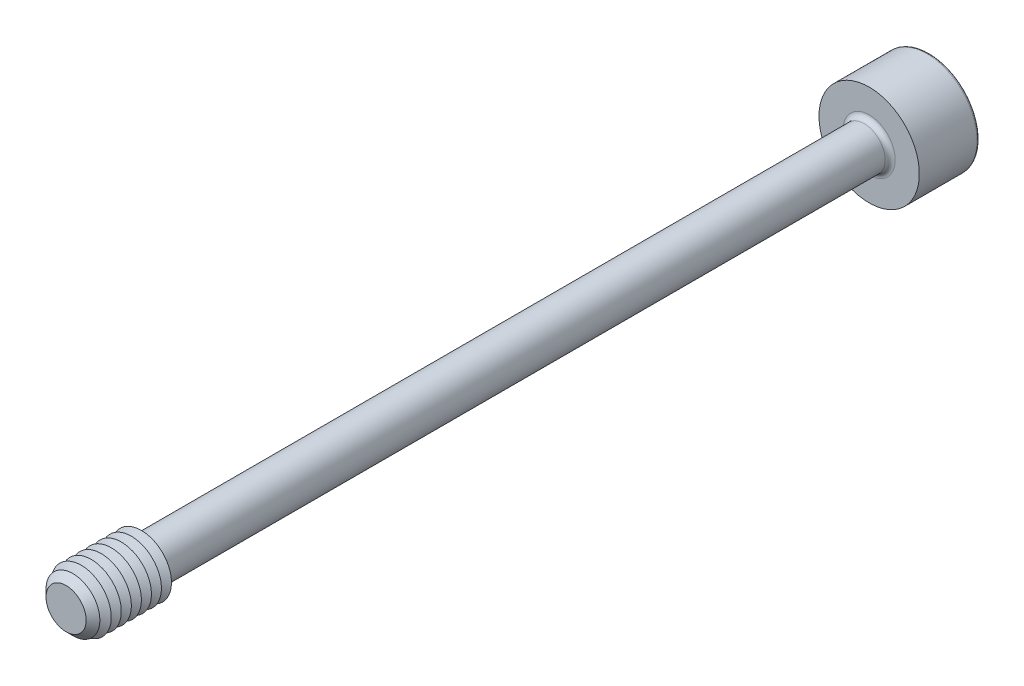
ISO-10303-21;
HEADER;
FILE_DESCRIPTION(('STEP AP214'),'2;1');
FILE_NAME('part.step','',(''),(''),'','','');
FILE_SCHEMA(('AUTOMOTIVE_DESIGN { 1 0 10303 214 1 1 1 1 }'));
ENDSEC;
DATA;
#1=APPLICATION_CONTEXT('core data for automotive mechanical design processes');
#2=APPLICATION_PROTOCOL_DEFINITION('international standard','automotive_design',2000,#1);
#3=PRODUCT_CONTEXT('',#1,'mechanical');
#4=PRODUCT('Part','Part','',(#3));
#5=PRODUCT_RELATED_PRODUCT_CATEGORY('part','',(#4));
#6=PRODUCT_DEFINITION_FORMATION('','',#4);
#7=PRODUCT_DEFINITION_CONTEXT('part definition',#1,'design');
#8=PRODUCT_DEFINITION('design','',#6,#7);
#9=PRODUCT_DEFINITION_SHAPE('','',#8);
#10=(LENGTH_UNIT() NAMED_UNIT(*) SI_UNIT(.MILLI.,.METRE.));
#11=(NAMED_UNIT(*) PLANE_ANGLE_UNIT() SI_UNIT($,.RADIAN.));
#12=(NAMED_UNIT(*) SI_UNIT($,.STERADIAN.) SOLID_ANGLE_UNIT());
#13=UNCERTAINTY_MEASURE_WITH_UNIT(LENGTH_MEASURE(1.E-05),#10,'distance_accuracy_value','');
#14=(GEOMETRIC_REPRESENTATION_CONTEXT(3) GLOBAL_UNCERTAINTY_ASSIGNED_CONTEXT((#13)) GLOBAL_UNIT_ASSIGNED_CONTEXT((#10,
#11,#12)) REPRESENTATION_CONTEXT('',''));
#15=CARTESIAN_POINT('',(0.,0.,0.));
#16=DIRECTION('',(0.,0.,1.));
#17=DIRECTION('',(1.,0.,0.));
#18=AXIS2_PLACEMENT_3D('',#15,#16,#17);
#19=CARTESIAN_POINT('',(-1.44337567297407,-2.5,-41.));
#20=DIRECTION('',(0.,0.,1.));
#21=DIRECTION('',(1.,0.,0.));
#22=AXIS2_PLACEMENT_3D('',#19,#20,#21);
#23=PLANE('',#22);
#24=DIRECTION('',(1.,0.,0.));
#25=VECTOR('',#24,1.);
#26=CARTESIAN_POINT('',(-1.44337567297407,-2.5,-41.));
#27=LINE('',#26,#25);
#28=CARTESIAN_POINT('',(0.,-2.5,-41.));
#29=VERTEX_POINT('',#28);
#30=CARTESIAN_POINT('',(1.44337567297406,-2.5,-41.));
#31=VERTEX_POINT('',#30);
#32=EDGE_CURVE('E726',#29,#31,#27,.T.);
#33=ORIENTED_EDGE('',*,*,#32,.F.);
#34=CARTESIAN_POINT('',(0.,0.,-41.));
#35=DIRECTION('',(0.,0.,1.));
#36=DIRECTION('',(0.,-1.,0.));
#37=AXIS2_PLACEMENT_3D('',#34,#35,#36);
#38=CIRCLE('',#37,2.5);
#39=CARTESIAN_POINT('',(2.1650635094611,-1.25,-41.));
#40=VERTEX_POINT('',#39);
#41=EDGE_CURVE('E53',#29,#40,#38,.T.);
#42=ORIENTED_EDGE('',*,*,#41,.T.);
#43=DIRECTION('',(0.5,0.866025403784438,0.));
#44=VECTOR('',#43,1.);
#45=CARTESIAN_POINT('',(1.44337567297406,-2.5,-41.));
#46=LINE('',#45,#44);
#47=EDGE_CURVE('E713',#31,#40,#46,.T.);
#48=ORIENTED_EDGE('',*,*,#47,.F.);
#49=EDGE_LOOP('',(#33,#42,#48));
#50=FACE_BOUND('',#49,.T.);
#51=ADVANCED_FACE('F41',(#50),#23,.F.);
#52=CARTESIAN_POINT('',(2.88675134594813,0.,-41.));
#53=VERTEX_POINT('',#52);
#54=EDGE_CURVE('E723',#40,#53,#46,.T.);
#55=ORIENTED_EDGE('',*,*,#54,.F.);
#56=CARTESIAN_POINT('',(2.1650635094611,1.25,-41.));
#57=VERTEX_POINT('',#56);
#58=EDGE_CURVE('E11',#40,#57,#38,.T.);
#59=ORIENTED_EDGE('',*,*,#58,.T.);
#60=DIRECTION('',(-0.5,0.866025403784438,0.));
#61=VECTOR('',#60,1.);
#62=CARTESIAN_POINT('',(2.88675134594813,0.,-41.));
#63=LINE('',#62,#61);
#64=EDGE_CURVE('E712',#53,#57,#63,.T.);
#65=ORIENTED_EDGE('',*,*,#64,.F.);
#66=EDGE_LOOP('',(#55,#59,#65));
#67=FACE_BOUND('',#66,.T.);
#68=ADVANCED_FACE('F133',(#67),#23,.F.);
#69=CARTESIAN_POINT('',(1.44337567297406,2.5,-41.));
#70=VERTEX_POINT('',#69);
#71=EDGE_CURVE('E707',#57,#70,#63,.T.);
#72=ORIENTED_EDGE('',*,*,#71,.F.);
#73=CARTESIAN_POINT('',(0.,2.5,-41.));
#74=VERTEX_POINT('',#73);
#75=EDGE_CURVE('E51',#57,#74,#38,.T.);
#76=ORIENTED_EDGE('',*,*,#75,.T.);
#77=DIRECTION('',(-1.,0.,0.));
#78=VECTOR('',#77,1.);
#79=CARTESIAN_POINT('',(1.44337567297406,2.5,-41.));
#80=LINE('',#79,#78);
#81=EDGE_CURVE('E177',#70,#74,#80,.T.);
#82=ORIENTED_EDGE('',*,*,#81,.F.);
#83=EDGE_LOOP('',(#72,#76,#82));
#84=FACE_BOUND('',#83,.T.);
#85=ADVANCED_FACE('F139',(#84),#23,.F.);
#86=CARTESIAN_POINT('',(-1.44337567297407,2.5,-41.));
#87=VERTEX_POINT('',#86);
#88=EDGE_CURVE('E717',#74,#87,#80,.T.);
#89=ORIENTED_EDGE('',*,*,#88,.F.);
#90=CARTESIAN_POINT('',(-2.1650635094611,1.25,-41.));
#91=VERTEX_POINT('',#90);
#92=EDGE_CURVE('E265',#74,#91,#38,.T.);
#93=ORIENTED_EDGE('',*,*,#92,.T.);
#94=DIRECTION('',(-0.5,-0.866025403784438,0.));
#95=VECTOR('',#94,1.);
#96=CARTESIAN_POINT('',(-1.44337567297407,2.5,-41.));
#97=LINE('',#96,#95);
#98=EDGE_CURVE('E176',#87,#91,#97,.T.);
#99=ORIENTED_EDGE('',*,*,#98,.F.);
#100=EDGE_LOOP('',(#89,#93,#99));
#101=FACE_BOUND('',#100,.T.);
#102=ADVANCED_FACE('F157',(#101),#23,.F.);
#103=CARTESIAN_POINT('',(-2.88675134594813,0.,-41.));
#104=VERTEX_POINT('',#103);
#105=EDGE_CURVE('E170',#91,#104,#97,.T.);
#106=ORIENTED_EDGE('',*,*,#105,.F.);
#107=CARTESIAN_POINT('',(-2.1650635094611,-1.25,-41.));
#108=VERTEX_POINT('',#107);
#109=EDGE_CURVE('E172',#91,#108,#38,.T.);
#110=ORIENTED_EDGE('',*,*,#109,.T.);
#111=DIRECTION('',(0.5,-0.866025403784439,0.));
#112=VECTOR('',#111,1.);
#113=CARTESIAN_POINT('',(-2.88675134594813,0.,-41.));
#114=LINE('',#113,#112);
#115=EDGE_CURVE('E174',#104,#108,#114,.T.);
#116=ORIENTED_EDGE('',*,*,#115,.F.);
#117=EDGE_LOOP('',(#106,#110,#116));
#118=FACE_BOUND('',#117,.T.);
#119=ADVANCED_FACE('F146',(#118),#23,.F.);
#120=CARTESIAN_POINT('',(0.,0.,-46.));
#121=DIRECTION('',(0.,0.,-1.));
#122=DIRECTION('',(-1.,0.,0.));
#123=AXIS2_PLACEMENT_3D('',#120,#121,#122);
#124=PLANE('',#123);
#125=CARTESIAN_POINT('',(0.,0.,-46.));
#126=DIRECTION('',(0.,0.,-1.));
#127=DIRECTION('',(-1.,0.,0.));
#128=AXIS2_PLACEMENT_3D('',#125,#126,#127);
#129=CIRCLE('',#128,4.75);
#130=CARTESIAN_POINT('',(-4.75,0.,-46.));
#131=VERTEX_POINT('',#130);
#132=EDGE_CURVE('E250',#131,#131,#129,.T.);
#133=ORIENTED_EDGE('',*,*,#132,.T.);
#134=EDGE_LOOP('',(#133));
#135=FACE_BOUND('',#134,.T.);
#136=DIRECTION('',(-0.5,-0.866025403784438,0.));
#137=VECTOR('',#136,1.);
#138=CARTESIAN_POINT('',(-1.44337567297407,2.5,-46.));
#139=LINE('',#138,#137);
#140=CARTESIAN_POINT('',(-1.44337567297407,2.5,-46.));
#141=VERTEX_POINT('',#140);
#142=CARTESIAN_POINT('',(-2.88675134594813,0.,-46.));
#143=VERTEX_POINT('',#142);
#144=EDGE_CURVE('E212',#141,#143,#139,.T.);
#145=ORIENTED_EDGE('',*,*,#144,.T.);
#146=DIRECTION('',(0.5,-0.866025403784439,0.));
#147=VECTOR('',#146,1.);
#148=CARTESIAN_POINT('',(-2.88675134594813,0.,-46.));
#149=LINE('',#148,#147);
#150=CARTESIAN_POINT('',(-1.44337567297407,-2.5,-46.));
#151=VERTEX_POINT('',#150);
#152=EDGE_CURVE('E67',#143,#151,#149,.T.);
#153=ORIENTED_EDGE('',*,*,#152,.T.);
#154=DIRECTION('',(1.,0.,0.));
#155=VECTOR('',#154,1.);
#156=CARTESIAN_POINT('',(-1.44337567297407,-2.5,-46.));
#157=LINE('',#156,#155);
#158=CARTESIAN_POINT('',(1.44337567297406,-2.5,-46.));
#159=VERTEX_POINT('',#158);
#160=EDGE_CURVE('E196',#151,#159,#157,.T.);
#161=ORIENTED_EDGE('',*,*,#160,.T.);
#162=DIRECTION('',(0.5,0.866025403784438,0.));
#163=VECTOR('',#162,1.);
#164=CARTESIAN_POINT('',(1.44337567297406,-2.5,-46.));
#165=LINE('',#164,#163);
#166=CARTESIAN_POINT('',(2.88675134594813,0.,-46.));
#167=VERTEX_POINT('',#166);
#168=EDGE_CURVE('E200',#159,#167,#165,.T.);
#169=ORIENTED_EDGE('',*,*,#168,.T.);
#170=DIRECTION('',(-0.5,0.866025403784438,0.));
#171=VECTOR('',#170,1.);
#172=CARTESIAN_POINT('',(2.88675134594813,0.,-46.));
#173=LINE('',#172,#171);
#174=CARTESIAN_POINT('',(1.44337567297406,2.5,-46.));
#175=VERTEX_POINT('',#174);
#176=EDGE_CURVE('E204',#167,#175,#173,.T.);
#177=ORIENTED_EDGE('',*,*,#176,.T.);
#178=DIRECTION('',(-1.,0.,0.));
#179=VECTOR('',#178,1.);
#180=CARTESIAN_POINT('',(1.44337567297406,2.5,-46.));
#181=LINE('',#180,#179);
#182=EDGE_CURVE('E208',#175,#141,#181,.T.);
#183=ORIENTED_EDGE('',*,*,#182,.T.);
#184=EDGE_LOOP('',(#145,#153,#161,#169,#177,#183));
#185=FACE_BOUND('',#184,.T.);
#186=ADVANCED_FACE('F156',(#135,#185),#124,.T.);
#187=CARTESIAN_POINT('',(0.,0.,40.));
#188=DIRECTION('',(0.,0.,-1.));
#189=DIRECTION('',(-1.,0.,0.));
#190=AXIS2_PLACEMENT_3D('',#187,#188,#189);
#191=CYLINDRICAL_SURFACE('',#190,2.1);
#192=CARTESIAN_POINT('',(0.,0.,-39.5));
#193=DIRECTION('',(0.,0.,-1.));
#194=DIRECTION('',(-1.,0.,0.));
#195=AXIS2_PLACEMENT_3D('',#192,#193,#194);
#196=CIRCLE('',#195,2.1);
#197=CARTESIAN_POINT('',(-2.1,0.,-39.5));
#198=VERTEX_POINT('',#197);
#199=EDGE_CURVE('E246',#198,#198,#196,.F.);
#200=ORIENTED_EDGE('',*,*,#199,.T.);
#201=EDGE_LOOP('',(#200));
#202=FACE_BOUND('',#201,.T.);
#203=CARTESIAN_POINT('',(0.,0.,31.9803847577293));
#204=DIRECTION('',(0.,0.,-1.));
#205=DIRECTION('',(0.,1.,0.));
#206=AXIS2_PLACEMENT_3D('',#203,#204,#205);
#207=CIRCLE('',#206,2.1);
#208=CARTESIAN_POINT('',(0.,2.1,31.9803847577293));
#209=VERTEX_POINT('',#208);
#210=EDGE_CURVE('E235',#209,#209,#207,.T.);
#211=ORIENTED_EDGE('',*,*,#210,.T.);
#212=EDGE_LOOP('',(#211));
#213=FACE_BOUND('',#212,.T.);
#214=ADVANCED_FACE('F163',(#202,#213),#191,.T.);
#215=CARTESIAN_POINT('',(0.,0.,31.9803847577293));
#216=DIRECTION('',(0.,0.,1.));
#217=DIRECTION('',(0.,-1.,0.));
#218=AXIS2_PLACEMENT_3D('',#215,#216,#217);
#219=CONICAL_SURFACE('',#218,2.1,1.0471975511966);
#220=CARTESIAN_POINT('',(0.,0.,32.5));
#221=DIRECTION('',(0.,0.,-1.));
#222=DIRECTION('',(-1.,0.,0.));
#223=AXIS2_PLACEMENT_3D('',#220,#221,#222);
#224=CIRCLE('',#223,3.);
#225=CARTESIAN_POINT('',(-3.,0.,32.5));
#226=VERTEX_POINT('',#225);
#227=EDGE_CURVE('E269',#226,#226,#224,.T.);
#228=ORIENTED_EDGE('',*,*,#227,.T.);
#229=EDGE_LOOP('',(#228));
#230=FACE_BOUND('',#229,.T.);
#231=ORIENTED_EDGE('',*,*,#210,.F.);
#232=EDGE_LOOP('',(#231));
#233=FACE_BOUND('',#232,.T.);
#234=ADVANCED_FACE('F484',(#230,#233),#219,.T.);
#235=CARTESIAN_POINT('',(0.,0.,-40.));
#236=DIRECTION('',(0.,0.,-1.));
#237=DIRECTION('',(-1.,0.,0.));
#238=AXIS2_PLACEMENT_3D('',#235,#236,#237);
#239=PLANE('',#238);
#240=CARTESIAN_POINT('',(0.,0.,-40.));
#241=DIRECTION('',(0.,0.,-1.));
#242=DIRECTION('',(-1.,0.,0.));
#243=AXIS2_PLACEMENT_3D('',#240,#241,#242);
#244=CIRCLE('',#243,2.6);
#245=CARTESIAN_POINT('',(-2.6,0.,-40.));
#246=VERTEX_POINT('',#245);
#247=EDGE_CURVE('E242',#246,#246,#244,.T.);
#248=ORIENTED_EDGE('',*,*,#247,.T.);
#249=EDGE_LOOP('',(#248));
#250=FACE_BOUND('',#249,.T.);
#251=CARTESIAN_POINT('',(0.,0.,-40.));
#252=DIRECTION('',(0.,0.,-1.));
#253=DIRECTION('',(-1.,0.,0.));
#254=AXIS2_PLACEMENT_3D('',#251,#252,#253);
#255=CIRCLE('',#254,5.);
#256=CARTESIAN_POINT('',(-5.,0.,-40.));
#257=VERTEX_POINT('',#256);
#258=EDGE_CURVE('E231',#257,#257,#255,.T.);
#259=ORIENTED_EDGE('',*,*,#258,.F.);
#260=EDGE_LOOP('',(#259));
#261=FACE_BOUND('',#260,.T.);
#262=ADVANCED_FACE('F477',(#250,#261),#239,.F.);
#263=CARTESIAN_POINT('',(0.,0.,-46.));
#264=DIRECTION('',(0.,0.,1.));
#265=DIRECTION('',(1.,0.,0.));
#266=AXIS2_PLACEMENT_3D('',#263,#264,#265);
#267=CYLINDRICAL_SURFACE('',#266,5.);
#268=CARTESIAN_POINT('',(0.,0.,-45.75));
#269=DIRECTION('',(0.,0.,-1.));
#270=DIRECTION('',(-1.,0.,0.));
#271=AXIS2_PLACEMENT_3D('',#268,#269,#270);
#272=CIRCLE('',#271,5.);
#273=CARTESIAN_POINT('',(-5.,0.,-45.75));
#274=VERTEX_POINT('',#273);
#275=EDGE_CURVE('E253',#274,#274,#272,.F.);
#276=ORIENTED_EDGE('',*,*,#275,.T.);
#277=EDGE_LOOP('',(#276));
#278=FACE_BOUND('',#277,.T.);
#279=ORIENTED_EDGE('',*,*,#258,.T.);
#280=EDGE_LOOP('',(#279));
#281=FACE_BOUND('',#280,.T.);
#282=ADVANCED_FACE('F483',(#278,#281),#267,.T.);
#283=CARTESIAN_POINT('',(-2.88675134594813,0.,-41.));
#284=DIRECTION('',(0.866025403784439,0.5,0.));
#285=DIRECTION('',(-0.5,0.866025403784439,0.));
#286=AXIS2_PLACEMENT_3D('',#283,#284,#285);
#287=PLANE('',#286);
#288=ORIENTED_EDGE('',*,*,#152,.F.);
#289=DIRECTION('',(0.,0.,-1.));
#290=VECTOR('',#289,1.);
#291=CARTESIAN_POINT('',(-2.88675134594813,0.,-41.));
#292=LINE('',#291,#290);
#293=EDGE_CURVE('E186',#104,#143,#292,.T.);
#294=ORIENTED_EDGE('',*,*,#293,.F.);
#295=ORIENTED_EDGE('',*,*,#115,.T.);
#296=CARTESIAN_POINT('',(-1.44337567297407,-2.5,-41.));
#297=VERTEX_POINT('',#296);
#298=EDGE_CURVE('E215',#108,#297,#114,.T.);
#299=ORIENTED_EDGE('',*,*,#298,.T.);
#300=DIRECTION('',(0.,0.,-1.));
#301=VECTOR('',#300,1.);
#302=CARTESIAN_POINT('',(-1.44337567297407,-2.5,-41.));
#303=LINE('',#302,#301);
#304=EDGE_CURVE('E228',#297,#151,#303,.T.);
#305=ORIENTED_EDGE('',*,*,#304,.T.);
#306=EDGE_LOOP('',(#288,#294,#295,#299,#305));
#307=FACE_BOUND('',#306,.T.);
#308=ADVANCED_FACE('F495',(#307),#287,.T.);
#309=CARTESIAN_POINT('',(-1.44337567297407,-2.5,-41.));
#310=DIRECTION('',(0.,1.,0.));
#311=DIRECTION('',(-1.,0.,0.));
#312=AXIS2_PLACEMENT_3D('',#309,#310,#311);
#313=PLANE('',#312);
#314=ORIENTED_EDGE('',*,*,#160,.F.);
#315=ORIENTED_EDGE('',*,*,#304,.F.);
#316=EDGE_CURVE('E724',#297,#29,#27,.T.);
#317=ORIENTED_EDGE('',*,*,#316,.T.);
#318=ORIENTED_EDGE('',*,*,#32,.T.);
#319=DIRECTION('',(0.,0.,-1.));
#320=VECTOR('',#319,1.);
#321=CARTESIAN_POINT('',(1.44337567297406,-2.5,-41.));
#322=LINE('',#321,#320);
#323=EDGE_CURVE('E225',#31,#159,#322,.T.);
#324=ORIENTED_EDGE('',*,*,#323,.T.);
#325=EDGE_LOOP('',(#314,#315,#317,#318,#324));
#326=FACE_BOUND('',#325,.T.);
#327=ADVANCED_FACE('F511',(#326),#313,.T.);
#328=CARTESIAN_POINT('',(1.44337567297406,-2.5,-41.));
#329=DIRECTION('',(-0.866025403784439,0.5,0.));
#330=DIRECTION('',(-0.5,-0.866025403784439,0.));
#331=AXIS2_PLACEMENT_3D('',#328,#329,#330);
#332=PLANE('',#331);
#333=ORIENTED_EDGE('',*,*,#168,.F.);
#334=ORIENTED_EDGE('',*,*,#323,.F.);
#335=ORIENTED_EDGE('',*,*,#47,.T.);
#336=ORIENTED_EDGE('',*,*,#54,.T.);
#337=DIRECTION('',(0.,0.,-1.));
#338=VECTOR('',#337,1.);
#339=CARTESIAN_POINT('',(2.88675134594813,0.,-41.));
#340=LINE('',#339,#338);
#341=EDGE_CURVE('E222',#53,#167,#340,.T.);
#342=ORIENTED_EDGE('',*,*,#341,.T.);
#343=EDGE_LOOP('',(#333,#334,#335,#336,#342));
#344=FACE_BOUND('',#343,.T.);
#345=ADVANCED_FACE('F521',(#344),#332,.T.);
#346=CARTESIAN_POINT('',(2.88675134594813,0.,-41.));
#347=DIRECTION('',(-0.866025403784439,-0.5,0.));
#348=DIRECTION('',(0.5,-0.866025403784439,0.));
#349=AXIS2_PLACEMENT_3D('',#346,#347,#348);
#350=PLANE('',#349);
#351=ORIENTED_EDGE('',*,*,#176,.F.);
#352=ORIENTED_EDGE('',*,*,#341,.F.);
#353=ORIENTED_EDGE('',*,*,#64,.T.);
#354=ORIENTED_EDGE('',*,*,#71,.T.);
#355=DIRECTION('',(0.,0.,-1.));
#356=VECTOR('',#355,1.);
#357=CARTESIAN_POINT('',(1.44337567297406,2.5,-41.));
#358=LINE('',#357,#356);
#359=EDGE_CURVE('E219',#70,#175,#358,.T.);
#360=ORIENTED_EDGE('',*,*,#359,.T.);
#361=EDGE_LOOP('',(#351,#352,#353,#354,#360));
#362=FACE_BOUND('',#361,.T.);
#363=ADVANCED_FACE('F531',(#362),#350,.T.);
#364=CARTESIAN_POINT('',(1.44337567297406,2.5,-41.));
#365=DIRECTION('',(0.,-1.,0.));
#366=DIRECTION('',(0.,0.,-1.));
#367=AXIS2_PLACEMENT_3D('',#364,#365,#366);
#368=PLANE('',#367);
#369=ORIENTED_EDGE('',*,*,#182,.F.);
#370=ORIENTED_EDGE('',*,*,#359,.F.);
#371=ORIENTED_EDGE('',*,*,#81,.T.);
#372=ORIENTED_EDGE('',*,*,#88,.T.);
#373=DIRECTION('',(0.,0.,-1.));
#374=VECTOR('',#373,1.);
#375=CARTESIAN_POINT('',(-1.44337567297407,2.5,-41.));
#376=LINE('',#375,#374);
#377=EDGE_CURVE('E182',#87,#141,#376,.T.);
#378=ORIENTED_EDGE('',*,*,#377,.T.);
#379=EDGE_LOOP('',(#369,#370,#371,#372,#378));
#380=FACE_BOUND('',#379,.T.);
#381=ADVANCED_FACE('F152',(#380),#368,.T.);
#382=CARTESIAN_POINT('',(-1.44337567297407,2.5,-41.));
#383=DIRECTION('',(0.866025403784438,-0.5,0.));
#384=DIRECTION('',(0.5,0.866025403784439,0.));
#385=AXIS2_PLACEMENT_3D('',#382,#383,#384);
#386=PLANE('',#385);
#387=ORIENTED_EDGE('',*,*,#144,.F.);
#388=ORIENTED_EDGE('',*,*,#377,.F.);
#389=ORIENTED_EDGE('',*,*,#98,.T.);
#390=ORIENTED_EDGE('',*,*,#105,.T.);
#391=ORIENTED_EDGE('',*,*,#293,.T.);
#392=EDGE_LOOP('',(#387,#388,#389,#390,#391));
#393=FACE_BOUND('',#392,.T.);
#394=ADVANCED_FACE('F144',(#393),#386,.T.);
#395=ORIENTED_EDGE('',*,*,#298,.F.);
#396=EDGE_CURVE('E256',#108,#29,#38,.T.);
#397=ORIENTED_EDGE('',*,*,#396,.T.);
#398=ORIENTED_EDGE('',*,*,#316,.F.);
#399=EDGE_LOOP('',(#395,#397,#398));
#400=FACE_BOUND('',#399,.T.);
#401=ADVANCED_FACE('F135',(#400),#23,.F.);
#402=CARTESIAN_POINT('',(0.,0.,-39.5));
#403=DIRECTION('',(0.,0.,-1.));
#404=DIRECTION('',(-1.,0.,0.));
#405=AXIS2_PLACEMENT_3D('',#402,#403,#404);
#406=TOROIDAL_SURFACE('',#405,2.6,0.5);
#407=ORIENTED_EDGE('',*,*,#199,.F.);
#408=EDGE_LOOP('',(#407));
#409=FACE_BOUND('',#408,.T.);
#410=ORIENTED_EDGE('',*,*,#247,.F.);
#411=EDGE_LOOP('',(#410));
#412=FACE_BOUND('',#411,.T.);
#413=ADVANCED_FACE('F129',(#409,#412),#406,.F.);
#414=CARTESIAN_POINT('',(0.,0.,-45.75));
#415=DIRECTION('',(0.,0.,-1.));
#416=DIRECTION('',(-1.,0.,0.));
#417=AXIS2_PLACEMENT_3D('',#414,#415,#416);
#418=TOROIDAL_SURFACE('',#417,4.75,0.25);
#419=ORIENTED_EDGE('',*,*,#275,.F.);
#420=EDGE_LOOP('',(#419));
#421=FACE_BOUND('',#420,.T.);
#422=ORIENTED_EDGE('',*,*,#132,.F.);
#423=EDGE_LOOP('',(#422));
#424=FACE_BOUND('',#423,.T.);
#425=ADVANCED_FACE('F43',(#421,#424),#418,.T.);
#426=CARTESIAN_POINT('',(0.,0.,-39.556624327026));
#427=DIRECTION('',(0.,0.,-1.));
#428=DIRECTION('',(0.,1.,0.));
#429=AXIS2_PLACEMENT_3D('',#426,#427,#428);
#430=CONICAL_SURFACE('',#429,0.,1.04719755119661);
#431=ORIENTED_EDGE('',*,*,#41,.F.);
#432=ORIENTED_EDGE('',*,*,#396,.F.);
#433=ORIENTED_EDGE('',*,*,#109,.F.);
#434=ORIENTED_EDGE('',*,*,#92,.F.);
#435=ORIENTED_EDGE('',*,*,#75,.F.);
#436=ORIENTED_EDGE('',*,*,#58,.F.);
#437=EDGE_LOOP('',(#431,#432,#433,#434,#435,#436));
#438=FACE_BOUND('',#437,.T.);
#439=CARTESIAN_POINT('',(0.,0.,-39.556624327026));
#440=VERTEX_POINT('',#439);
#441=VERTEX_LOOP('',#440);
#442=FACE_BOUND('',#441,.T.);
#443=ADVANCED_FACE('F118',(#438,#442),#430,.F.);
#444=CARTESIAN_POINT('',(0.,0.,33.));
#445=DIRECTION('',(0.,0.,-1.));
#446=DIRECTION('',(-1.,0.,0.));
#447=AXIS2_PLACEMENT_3D('',#444,#445,#446);
#448=CONICAL_SURFACE('',#447,2.13397459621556,1.0471975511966);
#449=ORIENTED_EDGE('',*,*,#227,.F.);
#450=EDGE_LOOP('',(#449));
#451=FACE_BOUND('',#450,.T.);
#452=CARTESIAN_POINT('',(0.,0.,33.));
#453=DIRECTION('',(0.,0.,-1.));
#454=DIRECTION('',(-1.,0.,0.));
#455=AXIS2_PLACEMENT_3D('',#452,#453,#454);
#456=CIRCLE('',#455,2.13397459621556);
#457=CARTESIAN_POINT('',(-2.13397459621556,0.,33.));
#458=VERTEX_POINT('',#457);
#459=EDGE_CURVE('E274',#458,#458,#456,.T.);
#460=ORIENTED_EDGE('',*,*,#459,.T.);
#461=EDGE_LOOP('',(#460));
#462=FACE_BOUND('',#461,.T.);
#463=ADVANCED_FACE('F120',(#451,#462),#448,.T.);
#464=CARTESIAN_POINT('',(0.,0.,33.5));
#465=DIRECTION('',(0.,0.,1.));
#466=DIRECTION('',(1.,0.,0.));
#467=AXIS2_PLACEMENT_3D('',#464,#465,#466);
#468=CONICAL_SURFACE('',#467,3.,1.0471975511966);
#469=ORIENTED_EDGE('',*,*,#459,.F.);
#470=EDGE_LOOP('',(#469));
#471=FACE_BOUND('',#470,.T.);
#472=CARTESIAN_POINT('',(0.,0.,33.5));
#473=DIRECTION('',(0.,0.,-1.));
#474=DIRECTION('',(-1.,0.,0.));
#475=AXIS2_PLACEMENT_3D('',#472,#473,#474);
#476=CIRCLE('',#475,3.);
#477=CARTESIAN_POINT('',(-3.,0.,33.5));
#478=VERTEX_POINT('',#477);
#479=EDGE_CURVE('E280',#478,#478,#476,.T.);
#480=ORIENTED_EDGE('',*,*,#479,.T.);
#481=EDGE_LOOP('',(#480));
#482=FACE_BOUND('',#481,.T.);
#483=ADVANCED_FACE('F126',(#471,#482),#468,.T.);
#484=CARTESIAN_POINT('',(0.,0.,34.));
#485=DIRECTION('',(0.,0.,-1.));
#486=DIRECTION('',(-1.,0.,0.));
#487=AXIS2_PLACEMENT_3D('',#484,#485,#486);
#488=CONICAL_SURFACE('',#487,2.13397459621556,1.0471975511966);
#489=ORIENTED_EDGE('',*,*,#479,.F.);
#490=EDGE_LOOP('',(#489));
#491=FACE_BOUND('',#490,.T.);
#492=CARTESIAN_POINT('',(0.,0.,34.));
#493=DIRECTION('',(0.,0.,-1.));
#494=DIRECTION('',(-1.,0.,0.));
#495=AXIS2_PLACEMENT_3D('',#492,#493,#494);
#496=CIRCLE('',#495,2.13397459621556);
#497=CARTESIAN_POINT('',(-2.13397459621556,0.,34.));
#498=VERTEX_POINT('',#497);
#499=EDGE_CURVE('E285',#498,#498,#496,.T.);
#500=ORIENTED_EDGE('',*,*,#499,.T.);
#501=EDGE_LOOP('',(#500));
#502=FACE_BOUND('',#501,.T.);
#503=ADVANCED_FACE('F381',(#491,#502),#488,.T.);
#504=CARTESIAN_POINT('',(0.,0.,34.5));
#505=DIRECTION('',(0.,0.,1.));
#506=DIRECTION('',(1.,0.,0.));
#507=AXIS2_PLACEMENT_3D('',#504,#505,#506);
#508=CONICAL_SURFACE('',#507,3.,1.0471975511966);
#509=ORIENTED_EDGE('',*,*,#499,.F.);
#510=EDGE_LOOP('',(#509));
#511=FACE_BOUND('',#510,.T.);
#512=CARTESIAN_POINT('',(0.,0.,34.5));
#513=DIRECTION('',(0.,0.,-1.));
#514=DIRECTION('',(-1.,0.,0.));
#515=AXIS2_PLACEMENT_3D('',#512,#513,#514);
#516=CIRCLE('',#515,3.);
#517=CARTESIAN_POINT('',(-3.,0.,34.5));
#518=VERTEX_POINT('',#517);
#519=EDGE_CURVE('E289',#518,#518,#516,.T.);
#520=ORIENTED_EDGE('',*,*,#519,.T.);
#521=EDGE_LOOP('',(#520));
#522=FACE_BOUND('',#521,.T.);
#523=ADVANCED_FACE('F377',(#511,#522),#508,.T.);
#524=CARTESIAN_POINT('',(0.,0.,35.));
#525=DIRECTION('',(0.,0.,-1.));
#526=DIRECTION('',(-1.,0.,0.));
#527=AXIS2_PLACEMENT_3D('',#524,#525,#526);
#528=CONICAL_SURFACE('',#527,2.13397459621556,1.0471975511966);
#529=ORIENTED_EDGE('',*,*,#519,.F.);
#530=EDGE_LOOP('',(#529));
#531=FACE_BOUND('',#530,.T.);
#532=CARTESIAN_POINT('',(0.,0.,35.));
#533=DIRECTION('',(0.,0.,-1.));
#534=DIRECTION('',(-1.,0.,0.));
#535=AXIS2_PLACEMENT_3D('',#532,#533,#534);
#536=CIRCLE('',#535,2.13397459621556);
#537=CARTESIAN_POINT('',(-2.13397459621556,0.,35.));
#538=VERTEX_POINT('',#537);
#539=EDGE_CURVE('E293',#538,#538,#536,.T.);
#540=ORIENTED_EDGE('',*,*,#539,.T.);
#541=EDGE_LOOP('',(#540));
#542=FACE_BOUND('',#541,.T.);
#543=ADVANCED_FACE('F373',(#531,#542),#528,.T.);
#544=CARTESIAN_POINT('',(0.,0.,35.5));
#545=DIRECTION('',(0.,0.,1.));
#546=DIRECTION('',(1.,0.,0.));
#547=AXIS2_PLACEMENT_3D('',#544,#545,#546);
#548=CONICAL_SURFACE('',#547,3.,1.0471975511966);
#549=ORIENTED_EDGE('',*,*,#539,.F.);
#550=EDGE_LOOP('',(#549));
#551=FACE_BOUND('',#550,.T.);
#552=CARTESIAN_POINT('',(0.,0.,35.5));
#553=DIRECTION('',(0.,0.,-1.));
#554=DIRECTION('',(-1.,0.,0.));
#555=AXIS2_PLACEMENT_3D('',#552,#553,#554);
#556=CIRCLE('',#555,3.);
#557=CARTESIAN_POINT('',(-3.,0.,35.5));
#558=VERTEX_POINT('',#557);
#559=EDGE_CURVE('E296',#558,#558,#556,.T.);
#560=ORIENTED_EDGE('',*,*,#559,.T.);
#561=EDGE_LOOP('',(#560));
#562=FACE_BOUND('',#561,.T.);
#563=ADVANCED_FACE('F369',(#551,#562),#548,.T.);
#564=CARTESIAN_POINT('',(0.,0.,36.));
#565=DIRECTION('',(0.,0.,-1.));
#566=DIRECTION('',(-1.,0.,0.));
#567=AXIS2_PLACEMENT_3D('',#564,#565,#566);
#568=CONICAL_SURFACE('',#567,2.13397459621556,1.0471975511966);
#569=ORIENTED_EDGE('',*,*,#559,.F.);
#570=EDGE_LOOP('',(#569));
#571=FACE_BOUND('',#570,.T.);
#572=CARTESIAN_POINT('',(0.,0.,36.));
#573=DIRECTION('',(0.,0.,-1.));
#574=DIRECTION('',(-1.,0.,0.));
#575=AXIS2_PLACEMENT_3D('',#572,#573,#574);
#576=CIRCLE('',#575,2.13397459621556);
#577=CARTESIAN_POINT('',(-2.13397459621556,0.,36.));
#578=VERTEX_POINT('',#577);
#579=EDGE_CURVE('E300',#578,#578,#576,.T.);
#580=ORIENTED_EDGE('',*,*,#579,.T.);
#581=EDGE_LOOP('',(#580));
#582=FACE_BOUND('',#581,.T.);
#583=ADVANCED_FACE('F365',(#571,#582),#568,.T.);
#584=CARTESIAN_POINT('',(0.,0.,36.5));
#585=DIRECTION('',(0.,0.,1.));
#586=DIRECTION('',(1.,0.,0.));
#587=AXIS2_PLACEMENT_3D('',#584,#585,#586);
#588=CONICAL_SURFACE('',#587,3.,1.0471975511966);
#589=ORIENTED_EDGE('',*,*,#579,.F.);
#590=EDGE_LOOP('',(#589));
#591=FACE_BOUND('',#590,.T.);
#592=CARTESIAN_POINT('',(0.,0.,36.5));
#593=DIRECTION('',(0.,0.,-1.));
#594=DIRECTION('',(-1.,0.,0.));
#595=AXIS2_PLACEMENT_3D('',#592,#593,#594);
#596=CIRCLE('',#595,3.);
#597=CARTESIAN_POINT('',(-3.,0.,36.5));
#598=VERTEX_POINT('',#597);
#599=EDGE_CURVE('E304',#598,#598,#596,.T.);
#600=ORIENTED_EDGE('',*,*,#599,.T.);
#601=EDGE_LOOP('',(#600));
#602=FACE_BOUND('',#601,.T.);
#603=ADVANCED_FACE('F361',(#591,#602),#588,.T.);
#604=CARTESIAN_POINT('',(0.,0.,37.));
#605=DIRECTION('',(0.,0.,-1.));
#606=DIRECTION('',(-1.,0.,0.));
#607=AXIS2_PLACEMENT_3D('',#604,#605,#606);
#608=CONICAL_SURFACE('',#607,2.13397459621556,1.0471975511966);
#609=ORIENTED_EDGE('',*,*,#599,.F.);
#610=EDGE_LOOP('',(#609));
#611=FACE_BOUND('',#610,.T.);
#612=CARTESIAN_POINT('',(0.,0.,37.));
#613=DIRECTION('',(0.,0.,-1.));
#614=DIRECTION('',(-1.,0.,0.));
#615=AXIS2_PLACEMENT_3D('',#612,#613,#614);
#616=CIRCLE('',#615,2.13397459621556);
#617=CARTESIAN_POINT('',(-2.13397459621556,0.,37.));
#618=VERTEX_POINT('',#617);
#619=EDGE_CURVE('E308',#618,#618,#616,.T.);
#620=ORIENTED_EDGE('',*,*,#619,.T.);
#621=EDGE_LOOP('',(#620));
#622=FACE_BOUND('',#621,.T.);
#623=ADVANCED_FACE('F357',(#611,#622),#608,.T.);
#624=CARTESIAN_POINT('',(0.,0.,37.5));
#625=DIRECTION('',(0.,0.,1.));
#626=DIRECTION('',(1.,0.,0.));
#627=AXIS2_PLACEMENT_3D('',#624,#625,#626);
#628=CONICAL_SURFACE('',#627,3.,1.0471975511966);
#629=ORIENTED_EDGE('',*,*,#619,.F.);
#630=EDGE_LOOP('',(#629));
#631=FACE_BOUND('',#630,.T.);
#632=CARTESIAN_POINT('',(0.,0.,37.5));
#633=DIRECTION('',(0.,0.,-1.));
#634=DIRECTION('',(-1.,0.,0.));
#635=AXIS2_PLACEMENT_3D('',#632,#633,#634);
#636=CIRCLE('',#635,3.);
#637=CARTESIAN_POINT('',(-3.,0.,37.5));
#638=VERTEX_POINT('',#637);
#639=EDGE_CURVE('E312',#638,#638,#636,.T.);
#640=ORIENTED_EDGE('',*,*,#639,.T.);
#641=EDGE_LOOP('',(#640));
#642=FACE_BOUND('',#641,.T.);
#643=ADVANCED_FACE('F353',(#631,#642),#628,.T.);
#644=CARTESIAN_POINT('',(0.,0.,38.));
#645=DIRECTION('',(0.,0.,-1.));
#646=DIRECTION('',(-1.,0.,0.));
#647=AXIS2_PLACEMENT_3D('',#644,#645,#646);
#648=CONICAL_SURFACE('',#647,2.13397459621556,1.0471975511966);
#649=ORIENTED_EDGE('',*,*,#639,.F.);
#650=EDGE_LOOP('',(#649));
#651=FACE_BOUND('',#650,.T.);
#652=CARTESIAN_POINT('',(0.,0.,38.));
#653=DIRECTION('',(0.,0.,-1.));
#654=DIRECTION('',(-1.,0.,0.));
#655=AXIS2_PLACEMENT_3D('',#652,#653,#654);
#656=CIRCLE('',#655,2.13397459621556);
#657=CARTESIAN_POINT('',(-2.13397459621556,0.,38.));
#658=VERTEX_POINT('',#657);
#659=EDGE_CURVE('E316',#658,#658,#656,.T.);
#660=ORIENTED_EDGE('',*,*,#659,.T.);
#661=EDGE_LOOP('',(#660));
#662=FACE_BOUND('',#661,.T.);
#663=ADVANCED_FACE('F349',(#651,#662),#648,.T.);
#664=CARTESIAN_POINT('',(0.,0.,38.5));
#665=DIRECTION('',(0.,0.,1.));
#666=DIRECTION('',(1.,0.,0.));
#667=AXIS2_PLACEMENT_3D('',#664,#665,#666);
#668=CONICAL_SURFACE('',#667,3.,1.0471975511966);
#669=ORIENTED_EDGE('',*,*,#659,.F.);
#670=EDGE_LOOP('',(#669));
#671=FACE_BOUND('',#670,.T.);
#672=CARTESIAN_POINT('',(0.,0.,38.5));
#673=DIRECTION('',(0.,0.,-1.));
#674=DIRECTION('',(-1.,0.,0.));
#675=AXIS2_PLACEMENT_3D('',#672,#673,#674);
#676=CIRCLE('',#675,3.);
#677=CARTESIAN_POINT('',(-3.,0.,38.5));
#678=VERTEX_POINT('',#677);
#679=EDGE_CURVE('E320',#678,#678,#676,.T.);
#680=ORIENTED_EDGE('',*,*,#679,.T.);
#681=EDGE_LOOP('',(#680));
#682=FACE_BOUND('',#681,.T.);
#683=ADVANCED_FACE('F342',(#671,#682),#668,.T.);
#684=CARTESIAN_POINT('',(0.,0.,39.));
#685=DIRECTION('',(0.,0.,-1.));
#686=DIRECTION('',(-1.,0.,0.));
#687=AXIS2_PLACEMENT_3D('',#684,#685,#686);
#688=CONICAL_SURFACE('',#687,2.13397459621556,1.0471975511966);
#689=ORIENTED_EDGE('',*,*,#679,.F.);
#690=EDGE_LOOP('',(#689));
#691=FACE_BOUND('',#690,.T.);
#692=CARTESIAN_POINT('',(0.,0.,39.));
#693=DIRECTION('',(0.,0.,-1.));
#694=DIRECTION('',(-1.,0.,0.));
#695=AXIS2_PLACEMENT_3D('',#692,#693,#694);
#696=CIRCLE('',#695,2.13397459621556);
#697=CARTESIAN_POINT('',(-2.13397459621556,0.,39.));
#698=VERTEX_POINT('',#697);
#699=EDGE_CURVE('E324',#698,#698,#696,.T.);
#700=ORIENTED_EDGE('',*,*,#699,.T.);
#701=EDGE_LOOP('',(#700));
#702=FACE_BOUND('',#701,.T.);
#703=ADVANCED_FACE('F328',(#691,#702),#688,.T.);
#704=CARTESIAN_POINT('',(0.,0.,39.5));
#705=DIRECTION('',(0.,0.,1.));
#706=DIRECTION('',(1.,0.,0.));
#707=AXIS2_PLACEMENT_3D('',#704,#705,#706);
#708=CONICAL_SURFACE('',#707,3.,1.0471975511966);
#709=CARTESIAN_POINT('',(0.,0.,39.3169872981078));
#710=DIRECTION('',(0.,0.,1.));
#711=DIRECTION('',(1.,0.,0.));
#712=AXIS2_PLACEMENT_3D('',#709,#710,#711);
#713=CIRCLE('',#712,2.68301270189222);
#714=CARTESIAN_POINT('',(2.68301270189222,0.,39.3169872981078));
#715=VERTEX_POINT('',#714);
#716=EDGE_CURVE('E45',#715,#715,#713,.F.);
#717=ORIENTED_EDGE('',*,*,#716,.T.);
#718=EDGE_LOOP('',(#717));
#719=FACE_BOUND('',#718,.T.);
#720=ORIENTED_EDGE('',*,*,#699,.F.);
#721=EDGE_LOOP('',(#720));
#722=FACE_BOUND('',#721,.T.);
#723=ADVANCED_FACE('F330',(#719,#722),#708,.T.);
#724=CARTESIAN_POINT('',(0.,0.,40.));
#725=DIRECTION('',(0.,0.,1.));
#726=DIRECTION('',(1.,0.,0.));
#727=AXIS2_PLACEMENT_3D('',#724,#725,#726);
#728=PLANE('',#727);
#729=CARTESIAN_POINT('',(0.,0.,40.));
#730=DIRECTION('',(0.,0.,1.));
#731=DIRECTION('',(1.,0.,0.));
#732=AXIS2_PLACEMENT_3D('',#729,#730,#731);
#733=CIRCLE('',#732,2.);
#734=CARTESIAN_POINT('',(2.,0.,40.));
#735=VERTEX_POINT('',#734);
#736=EDGE_CURVE('E238',#735,#735,#733,.T.);
#737=ORIENTED_EDGE('',*,*,#736,.T.);
#738=EDGE_LOOP('',(#737));
#739=FACE_BOUND('',#738,.T.);
#740=ADVANCED_FACE('F332',(#739),#728,.T.);
#741=CARTESIAN_POINT('',(0.,0.,39.));
#742=DIRECTION('',(0.,0.,-1.));
#743=DIRECTION('',(0.,1.,0.));
#744=AXIS2_PLACEMENT_3D('',#741,#742,#743);
#745=CONICAL_SURFACE('',#744,3.,0.785398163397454);
#746=ORIENTED_EDGE('',*,*,#716,.F.);
#747=EDGE_LOOP('',(#746));
#748=FACE_BOUND('',#747,.T.);
#749=ORIENTED_EDGE('',*,*,#736,.F.);
#750=EDGE_LOOP('',(#749));
#751=FACE_BOUND('',#750,.T.);
#752=ADVANCED_FACE('F339',(#748,#751),#745,.T.);
#753=CLOSED_SHELL('',(#51,#68,#85,#102,#119,#186,#214,#234,#262,#282,#308,#327,#345,#363,#381,
#394,#401,#413,#425,#443,#463,#483,#503,#523,#543,#563,#583,#603,#623,#643,#663,#683,#703,#723,
#740,#752));
#754=MANIFOLD_SOLID_BREP('B2',#753);
#755=ADVANCED_BREP_SHAPE_REPRESENTATION('',(#18,#754),#14);
#756=SHAPE_DEFINITION_REPRESENTATION(#9,#755);
ENDSEC;
END-ISO-10303-21;
